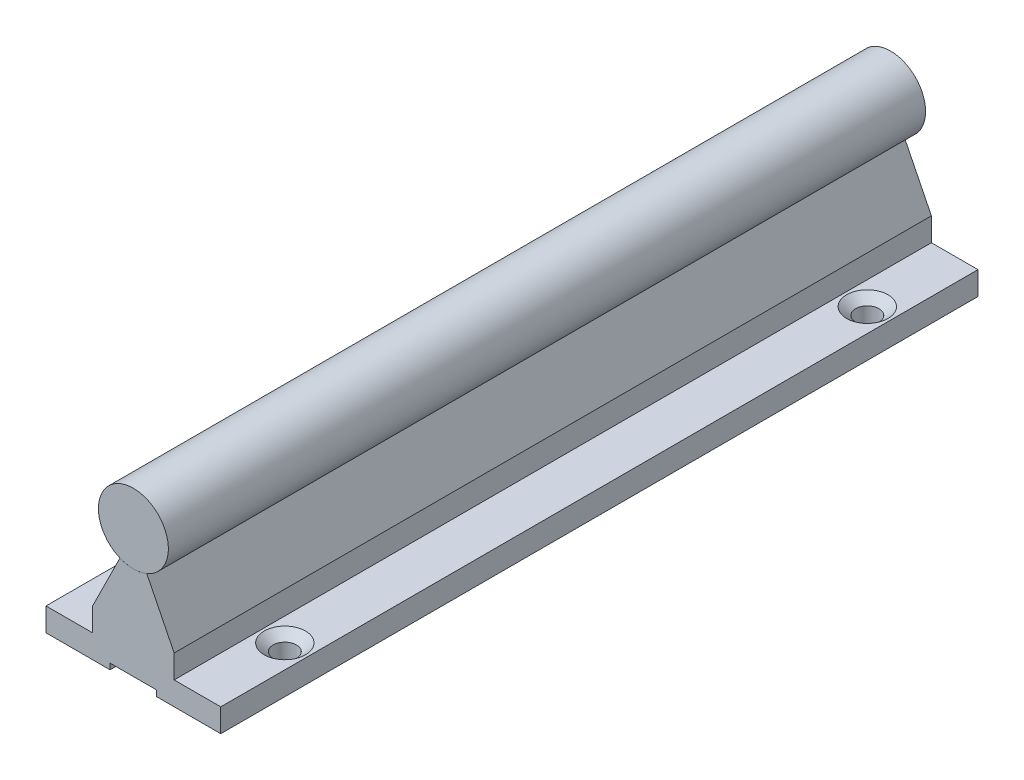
ISO-10303-21;
HEADER;
FILE_DESCRIPTION(('STEP AP214'),'2;1');
FILE_NAME('part.step','',(''),(''),'','','');
FILE_SCHEMA(('AUTOMOTIVE_DESIGN { 1 0 10303 214 1 1 1 1 }'));
ENDSEC;
DATA;
#1=APPLICATION_CONTEXT('core data for automotive mechanical design processes');
#2=APPLICATION_PROTOCOL_DEFINITION('international standard','automotive_design',2000,#1);
#3=PRODUCT_CONTEXT('',#1,'mechanical');
#4=PRODUCT('Part','Part','',(#3));
#5=PRODUCT_RELATED_PRODUCT_CATEGORY('part','',(#4));
#6=PRODUCT_DEFINITION_FORMATION('','',#4);
#7=PRODUCT_DEFINITION_CONTEXT('part definition',#1,'design');
#8=PRODUCT_DEFINITION('design','',#6,#7);
#9=PRODUCT_DEFINITION_SHAPE('','',#8);
#10=(LENGTH_UNIT() NAMED_UNIT(*) SI_UNIT(.MILLI.,.METRE.));
#11=(NAMED_UNIT(*) PLANE_ANGLE_UNIT() SI_UNIT($,.RADIAN.));
#12=(NAMED_UNIT(*) SI_UNIT($,.STERADIAN.) SOLID_ANGLE_UNIT());
#13=UNCERTAINTY_MEASURE_WITH_UNIT(LENGTH_MEASURE(1.E-05),#10,'distance_accuracy_value','');
#14=(GEOMETRIC_REPRESENTATION_CONTEXT(3) GLOBAL_UNCERTAINTY_ASSIGNED_CONTEXT((#13)) GLOBAL_UNIT_ASSIGNED_CONTEXT((#10,
#11,#12)) REPRESENTATION_CONTEXT('',''));
#15=CARTESIAN_POINT('',(0.,0.,0.));
#16=DIRECTION('',(0.,0.,1.));
#17=DIRECTION('',(1.,0.,0.));
#18=AXIS2_PLACEMENT_3D('',#15,#16,#17);
#19=CARTESIAN_POINT('',(0.,8.5,750.));
#20=DIRECTION('',(0.,0.,-1.));
#21=DIRECTION('',(-1.,0.,0.));
#22=AXIS2_PLACEMENT_3D('',#19,#20,#21);
#23=CYLINDRICAL_SURFACE('',#22,6.);
#24=CARTESIAN_POINT('',(0.,8.5,324.866250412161));
#25=DIRECTION('',(0.,0.,1.));
#26=DIRECTION('',(1.,0.,0.));
#27=AXIS2_PLACEMENT_3D('',#24,#25,#26);
#28=CIRCLE('',#27,6.);
#29=CARTESIAN_POINT('',(6.,8.5,324.866250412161));
#30=VERTEX_POINT('',#29);
#31=EDGE_CURVE('E11',#30,#30,#28,.T.);
#32=ORIENTED_EDGE('',*,*,#31,.T.);
#33=EDGE_LOOP('',(#32));
#34=FACE_BOUND('',#33,.T.);
#35=CARTESIAN_POINT('',(0.,8.5,454.866250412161));
#36=DIRECTION('',(0.,0.,-1.));
#37=DIRECTION('',(-1.,0.,0.));
#38=AXIS2_PLACEMENT_3D('',#35,#36,#37);
#39=CIRCLE('',#38,6.);
#40=CARTESIAN_POINT('',(-6.,8.5,454.866250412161));
#41=VERTEX_POINT('',#40);
#42=EDGE_CURVE('E60',#41,#41,#39,.T.);
#43=ORIENTED_EDGE('',*,*,#42,.T.);
#44=EDGE_LOOP('',(#43));
#45=FACE_BOUND('',#44,.T.);
#46=ADVANCED_FACE('F54',(#34,#45),#23,.T.);
#47=CARTESIAN_POINT('',(-15.,71.5,454.866250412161));
#48=DIRECTION('',(0.,0.,-1.));
#49=DIRECTION('',(-1.,0.,0.));
#50=AXIS2_PLACEMENT_3D('',#47,#48,#49);
#51=PLANE('',#50);
#52=ORIENTED_EDGE('',*,*,#42,.F.);
#53=EDGE_LOOP('',(#52));
#54=FACE_BOUND('',#53,.T.);
#55=ADVANCED_FACE('F67',(#54),#51,.F.);
#56=CARTESIAN_POINT('',(-15.,71.5,324.866250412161));
#57=DIRECTION('',(0.,0.,1.));
#58=DIRECTION('',(1.,0.,0.));
#59=AXIS2_PLACEMENT_3D('',#56,#57,#58);
#60=PLANE('',#59);
#61=ORIENTED_EDGE('',*,*,#31,.F.);
#62=EDGE_LOOP('',(#61));
#63=FACE_BOUND('',#62,.T.);
#64=ADVANCED_FACE('F69',(#63),#60,.F.);
#65=CLOSED_SHELL('',(#46,#55,#64));
#66=MANIFOLD_SOLID_BREP('B2',#65);
#67=CARTESIAN_POINT('',(-15.,-10.5,750.));
#68=DIRECTION('',(0.,-1.,0.));
#69=DIRECTION('',(0.,0.,-1.));
#70=AXIS2_PLACEMENT_3D('',#67,#68,#69);
#71=PLANE('',#70);
#72=CARTESIAN_POINT('',(-11.000000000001,-10.5,439.866250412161));
#73=DIRECTION('',(0.,1.,0.));
#74=DIRECTION('',(0.,0.,1.));
#75=AXIS2_PLACEMENT_3D('',#72,#73,#74);
#76=CIRCLE('',#75,3.5433);
#77=CARTESIAN_POINT('',(-11.000000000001,-10.5,443.409550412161));
#78=VERTEX_POINT('',#77);
#79=EDGE_CURVE('E263',#78,#78,#76,.T.);
#80=ORIENTED_EDGE('',*,*,#79,.F.);
#81=EDGE_LOOP('',(#80));
#82=FACE_BOUND('',#81,.T.);
#83=CARTESIAN_POINT('',(-11.0000000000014,-10.5,339.866250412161));
#84=DIRECTION('',(0.,1.,0.));
#85=DIRECTION('',(0.,0.,1.));
#86=AXIS2_PLACEMENT_3D('',#83,#84,#85);
#87=CIRCLE('',#86,3.5433);
#88=CARTESIAN_POINT('',(-11.0000000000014,-10.5,343.409550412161));
#89=VERTEX_POINT('',#88);
#90=EDGE_CURVE('E280',#89,#89,#87,.T.);
#91=ORIENTED_EDGE('',*,*,#90,.F.);
#92=EDGE_LOOP('',(#91));
#93=FACE_BOUND('',#92,.T.);
#94=DIRECTION('',(0.,0.,-1.));
#95=VECTOR('',#94,1.);
#96=CARTESIAN_POINT('',(-7.,-10.5,750.));
#97=LINE('',#96,#95);
#98=CARTESIAN_POINT('',(-7.,-10.5,454.866250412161));
#99=VERTEX_POINT('',#98);
#100=CARTESIAN_POINT('',(-7.,-10.5,324.866250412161));
#101=VERTEX_POINT('',#100);
#102=EDGE_CURVE('E225',#99,#101,#97,.T.);
#103=ORIENTED_EDGE('',*,*,#102,.T.);
#104=DIRECTION('',(-1.,0.,0.));
#105=VECTOR('',#104,1.);
#106=CARTESIAN_POINT('',(-15.,-10.5,324.866250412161));
#107=LINE('',#106,#105);
#108=CARTESIAN_POINT('',(-15.,-10.5,324.866250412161));
#109=VERTEX_POINT('',#108);
#110=EDGE_CURVE('E261',#101,#109,#107,.T.);
#111=ORIENTED_EDGE('',*,*,#110,.T.);
#112=DIRECTION('',(0.,0.,-1.));
#113=VECTOR('',#112,1.);
#114=CARTESIAN_POINT('',(-15.,-10.5,750.));
#115=LINE('',#114,#113);
#116=CARTESIAN_POINT('',(-15.,-10.5,454.866250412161));
#117=VERTEX_POINT('',#116);
#118=EDGE_CURVE('E219',#117,#109,#115,.T.);
#119=ORIENTED_EDGE('',*,*,#118,.F.);
#120=DIRECTION('',(1.,0.,0.));
#121=VECTOR('',#120,1.);
#122=CARTESIAN_POINT('',(-15.,-10.5,454.866250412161));
#123=LINE('',#122,#121);
#124=EDGE_CURVE('E356',#117,#99,#123,.T.);
#125=ORIENTED_EDGE('',*,*,#124,.T.);
#126=EDGE_LOOP('',(#103,#111,#119,#125));
#127=FACE_BOUND('',#126,.T.);
#128=ADVANCED_FACE('F98',(#82,#93,#127),#71,.F.);
#129=CARTESIAN_POINT('',(15.,-10.5,750.));
#130=DIRECTION('',(-1.,0.,0.));
#131=DIRECTION('',(0.,0.,1.));
#132=AXIS2_PLACEMENT_3D('',#129,#130,#131);
#133=PLANE('',#132);
#134=DIRECTION('',(0.,0.,-1.));
#135=VECTOR('',#134,1.);
#136=CARTESIAN_POINT('',(15.,-14.5,750.));
#137=LINE('',#136,#135);
#138=CARTESIAN_POINT('',(15.,-14.5,454.866250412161));
#139=VERTEX_POINT('',#138);
#140=CARTESIAN_POINT('',(15.,-14.5,324.866250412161));
#141=VERTEX_POINT('',#140);
#142=EDGE_CURVE('E293',#139,#141,#137,.T.);
#143=ORIENTED_EDGE('',*,*,#142,.T.);
#144=DIRECTION('',(0.,-1.,0.));
#145=VECTOR('',#144,1.);
#146=CARTESIAN_POINT('',(15.,71.5,324.866250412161));
#147=LINE('',#146,#145);
#148=CARTESIAN_POINT('',(15.,-10.5,324.866250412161));
#149=VERTEX_POINT('',#148);
#150=EDGE_CURVE('E122',#149,#141,#147,.T.);
#151=ORIENTED_EDGE('',*,*,#150,.F.);
#152=DIRECTION('',(0.,0.,-1.));
#153=VECTOR('',#152,1.);
#154=CARTESIAN_POINT('',(15.,-10.5,750.));
#155=LINE('',#154,#153);
#156=CARTESIAN_POINT('',(15.,-10.5,454.866250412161));
#157=VERTEX_POINT('',#156);
#158=EDGE_CURVE('E52',#157,#149,#155,.T.);
#159=ORIENTED_EDGE('',*,*,#158,.F.);
#160=DIRECTION('',(0.,-1.,0.));
#161=VECTOR('',#160,1.);
#162=CARTESIAN_POINT('',(15.,71.5,454.866250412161));
#163=LINE('',#162,#161);
#164=EDGE_CURVE('E369',#157,#139,#163,.T.);
#165=ORIENTED_EDGE('',*,*,#164,.T.);
#166=EDGE_LOOP('',(#143,#151,#159,#165));
#167=FACE_BOUND('',#166,.T.);
#168=ADVANCED_FACE('F100',(#167),#133,.F.);
#169=CARTESIAN_POINT('',(7.,-10.5,750.));
#170=DIRECTION('',(0.,-1.,0.));
#171=DIRECTION('',(0.,0.,-1.));
#172=AXIS2_PLACEMENT_3D('',#169,#170,#171);
#173=PLANE('',#172);
#174=CARTESIAN_POINT('',(10.999999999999,-10.5,439.866250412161));
#175=DIRECTION('',(0.,1.,0.));
#176=DIRECTION('',(0.,0.,1.));
#177=AXIS2_PLACEMENT_3D('',#174,#175,#176);
#178=CIRCLE('',#177,3.5433);
#179=CARTESIAN_POINT('',(10.999999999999,-10.5,443.409550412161));
#180=VERTEX_POINT('',#179);
#181=EDGE_CURVE('E274',#180,#180,#178,.T.);
#182=ORIENTED_EDGE('',*,*,#181,.F.);
#183=EDGE_LOOP('',(#182));
#184=FACE_BOUND('',#183,.T.);
#185=CARTESIAN_POINT('',(10.9999999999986,-10.5,339.866250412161));
#186=DIRECTION('',(0.,1.,0.));
#187=DIRECTION('',(0.,0.,1.));
#188=AXIS2_PLACEMENT_3D('',#185,#186,#187);
#189=CIRCLE('',#188,3.5433);
#190=CARTESIAN_POINT('',(10.9999999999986,-10.5,343.409550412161));
#191=VERTEX_POINT('',#190);
#192=EDGE_CURVE('E283',#191,#191,#189,.T.);
#193=ORIENTED_EDGE('',*,*,#192,.F.);
#194=EDGE_LOOP('',(#193));
#195=FACE_BOUND('',#194,.T.);
#196=ORIENTED_EDGE('',*,*,#158,.T.);
#197=DIRECTION('',(-1.,0.,0.));
#198=VECTOR('',#197,1.);
#199=CARTESIAN_POINT('',(7.,-10.5,324.866250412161));
#200=LINE('',#199,#198);
#201=CARTESIAN_POINT('',(7.,-10.5,324.866250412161));
#202=VERTEX_POINT('',#201);
#203=EDGE_CURVE('E260',#149,#202,#200,.T.);
#204=ORIENTED_EDGE('',*,*,#203,.T.);
#205=DIRECTION('',(0.,0.,-1.));
#206=VECTOR('',#205,1.);
#207=CARTESIAN_POINT('',(7.,-10.5,750.));
#208=LINE('',#207,#206);
#209=CARTESIAN_POINT('',(7.,-10.5,454.866250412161));
#210=VERTEX_POINT('',#209);
#211=EDGE_CURVE('E107',#210,#202,#208,.T.);
#212=ORIENTED_EDGE('',*,*,#211,.F.);
#213=DIRECTION('',(1.,0.,0.));
#214=VECTOR('',#213,1.);
#215=CARTESIAN_POINT('',(7.,-10.5,454.866250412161));
#216=LINE('',#215,#214);
#217=EDGE_CURVE('E258',#210,#157,#216,.T.);
#218=ORIENTED_EDGE('',*,*,#217,.T.);
#219=EDGE_LOOP('',(#196,#204,#212,#218));
#220=FACE_BOUND('',#219,.T.);
#221=ADVANCED_FACE('F257',(#184,#195,#220),#173,.F.);
#222=CARTESIAN_POINT('',(7.,-10.5,750.));
#223=DIRECTION('',(-1.,0.,0.));
#224=DIRECTION('',(0.,-1.,0.));
#225=AXIS2_PLACEMENT_3D('',#222,#223,#224);
#226=PLANE('',#225);
#227=ORIENTED_EDGE('',*,*,#211,.T.);
#228=DIRECTION('',(0.,1.,0.));
#229=VECTOR('',#228,1.);
#230=CARTESIAN_POINT('',(7.,-10.5,324.866250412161));
#231=LINE('',#230,#229);
#232=CARTESIAN_POINT('',(7.,-6.5,324.866250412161));
#233=VERTEX_POINT('',#232);
#234=EDGE_CURVE('E252',#202,#233,#231,.T.);
#235=ORIENTED_EDGE('',*,*,#234,.T.);
#236=DIRECTION('',(0.,0.,-1.));
#237=VECTOR('',#236,1.);
#238=CARTESIAN_POINT('',(7.,-6.5,750.));
#239=LINE('',#238,#237);
#240=CARTESIAN_POINT('',(7.,-6.5,454.866250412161));
#241=VERTEX_POINT('',#240);
#242=EDGE_CURVE('E242',#241,#233,#239,.T.);
#243=ORIENTED_EDGE('',*,*,#242,.F.);
#244=DIRECTION('',(0.,-1.,0.));
#245=VECTOR('',#244,1.);
#246=CARTESIAN_POINT('',(7.,-10.5,454.866250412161));
#247=LINE('',#246,#245);
#248=EDGE_CURVE('E253',#241,#210,#247,.T.);
#249=ORIENTED_EDGE('',*,*,#248,.T.);
#250=EDGE_LOOP('',(#227,#235,#243,#249));
#251=FACE_BOUND('',#250,.T.);
#252=ADVANCED_FACE('F250',(#251),#226,.F.);
#253=CARTESIAN_POINT('',(7.,-6.5,750.));
#254=DIRECTION('',(-0.895711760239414,-0.444635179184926,0.));
#255=DIRECTION('',(0.444635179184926,-0.895711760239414,0.));
#256=AXIS2_PLACEMENT_3D('',#253,#254,#255);
#257=PLANE('',#256);
#258=ORIENTED_EDGE('',*,*,#242,.T.);
#259=DIRECTION('',(-0.444635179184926,0.895711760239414,0.));
#260=VECTOR('',#259,1.);
#261=CARTESIAN_POINT('',(7.,-6.5,324.866250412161));
#262=LINE('',#261,#260);
#263=CARTESIAN_POINT('',(2.30401201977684,2.9600064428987,324.866250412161));
#264=VERTEX_POINT('',#263);
#265=EDGE_CURVE('E265',#233,#264,#262,.T.);
#266=ORIENTED_EDGE('',*,*,#265,.T.);
#267=DIRECTION('',(0.,0.,-1.));
#268=VECTOR('',#267,1.);
#269=CARTESIAN_POINT('',(2.30401201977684,2.9600064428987,750.));
#270=LINE('',#269,#268);
#271=CARTESIAN_POINT('',(2.30401201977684,2.9600064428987,454.866250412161));
#272=VERTEX_POINT('',#271);
#273=EDGE_CURVE('E239',#272,#264,#270,.T.);
#274=ORIENTED_EDGE('',*,*,#273,.F.);
#275=DIRECTION('',(0.444635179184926,-0.895711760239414,0.));
#276=VECTOR('',#275,1.);
#277=CARTESIAN_POINT('',(7.,-6.5,454.866250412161));
#278=LINE('',#277,#276);
#279=EDGE_CURVE('E346',#272,#241,#278,.T.);
#280=ORIENTED_EDGE('',*,*,#279,.T.);
#281=EDGE_LOOP('',(#258,#266,#274,#280));
#282=FACE_BOUND('',#281,.T.);
#283=ADVANCED_FACE('F338',(#282),#257,.F.);
#284=CARTESIAN_POINT('',(0.,8.5,750.));
#285=DIRECTION('',(0.,0.,-1.));
#286=DIRECTION('',(-1.,0.,0.));
#287=AXIS2_PLACEMENT_3D('',#284,#285,#286);
#288=CYLINDRICAL_SURFACE('',#287,6.);
#289=ORIENTED_EDGE('',*,*,#273,.T.);
#290=CARTESIAN_POINT('',(0.,8.5,324.866250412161));
#291=DIRECTION('',(0.,0.,1.));
#292=DIRECTION('',(1.,0.,0.));
#293=AXIS2_PLACEMENT_3D('',#290,#291,#292);
#294=CIRCLE('',#293,6.);
#295=CARTESIAN_POINT('',(-2.30401201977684,2.96000644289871,324.866250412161));
#296=VERTEX_POINT('',#295);
#297=EDGE_CURVE('E333',#264,#296,#294,.F.);
#298=ORIENTED_EDGE('',*,*,#297,.T.);
#299=DIRECTION('',(0.,0.,-1.));
#300=VECTOR('',#299,1.);
#301=CARTESIAN_POINT('',(-2.30401201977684,2.96000644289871,750.));
#302=LINE('',#301,#300);
#303=CARTESIAN_POINT('',(-2.30401201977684,2.96000644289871,454.866250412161));
#304=VERTEX_POINT('',#303);
#305=EDGE_CURVE('E236',#304,#296,#302,.T.);
#306=ORIENTED_EDGE('',*,*,#305,.F.);
#307=CARTESIAN_POINT('',(0.,8.5,454.866250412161));
#308=DIRECTION('',(0.,0.,-1.));
#309=DIRECTION('',(-1.,0.,0.));
#310=AXIS2_PLACEMENT_3D('',#307,#308,#309);
#311=CIRCLE('',#310,6.);
#312=EDGE_CURVE('E344',#304,#272,#311,.F.);
#313=ORIENTED_EDGE('',*,*,#312,.T.);
#314=EDGE_LOOP('',(#289,#298,#306,#313));
#315=FACE_BOUND('',#314,.T.);
#316=ADVANCED_FACE('F342',(#315),#288,.F.);
#317=CARTESIAN_POINT('',(-7.,-6.5,750.));
#318=DIRECTION('',(0.895711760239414,-0.444635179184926,0.));
#319=DIRECTION('',(0.444635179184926,0.895711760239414,0.));
#320=AXIS2_PLACEMENT_3D('',#317,#318,#319);
#321=PLANE('',#320);
#322=ORIENTED_EDGE('',*,*,#305,.T.);
#323=DIRECTION('',(-0.444635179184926,-0.895711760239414,0.));
#324=VECTOR('',#323,1.);
#325=CARTESIAN_POINT('',(-7.,-6.5,324.866250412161));
#326=LINE('',#325,#324);
#327=CARTESIAN_POINT('',(-7.,-6.5,324.866250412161));
#328=VERTEX_POINT('',#327);
#329=EDGE_CURVE('E325',#296,#328,#326,.T.);
#330=ORIENTED_EDGE('',*,*,#329,.T.);
#331=DIRECTION('',(0.,0.,-1.));
#332=VECTOR('',#331,1.);
#333=CARTESIAN_POINT('',(-7.,-6.5,750.));
#334=LINE('',#333,#332);
#335=CARTESIAN_POINT('',(-7.,-6.5,454.866250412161));
#336=VERTEX_POINT('',#335);
#337=EDGE_CURVE('E233',#336,#328,#334,.T.);
#338=ORIENTED_EDGE('',*,*,#337,.F.);
#339=DIRECTION('',(0.444635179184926,0.895711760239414,0.));
#340=VECTOR('',#339,1.);
#341=CARTESIAN_POINT('',(-7.,-6.5,454.866250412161));
#342=LINE('',#341,#340);
#343=EDGE_CURVE('E347',#336,#304,#342,.T.);
#344=ORIENTED_EDGE('',*,*,#343,.T.);
#345=EDGE_LOOP('',(#322,#330,#338,#344));
#346=FACE_BOUND('',#345,.T.);
#347=ADVANCED_FACE('F381',(#346),#321,.F.);
#348=CARTESIAN_POINT('',(-7.,-10.5,750.));
#349=DIRECTION('',(1.,0.,0.));
#350=DIRECTION('',(0.,1.,0.));
#351=AXIS2_PLACEMENT_3D('',#348,#349,#350);
#352=PLANE('',#351);
#353=ORIENTED_EDGE('',*,*,#337,.T.);
#354=DIRECTION('',(0.,-1.,0.));
#355=VECTOR('',#354,1.);
#356=CARTESIAN_POINT('',(-7.,-10.5,324.866250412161));
#357=LINE('',#356,#355);
#358=EDGE_CURVE('E322',#328,#101,#357,.T.);
#359=ORIENTED_EDGE('',*,*,#358,.T.);
#360=ORIENTED_EDGE('',*,*,#102,.F.);
#361=DIRECTION('',(0.,1.,0.));
#362=VECTOR('',#361,1.);
#363=CARTESIAN_POINT('',(-7.,-10.5,454.866250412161));
#364=LINE('',#363,#362);
#365=EDGE_CURVE('E350',#99,#336,#364,.T.);
#366=ORIENTED_EDGE('',*,*,#365,.T.);
#367=EDGE_LOOP('',(#353,#359,#360,#366));
#368=FACE_BOUND('',#367,.T.);
#369=ADVANCED_FACE('F379',(#368),#352,.F.);
#370=CARTESIAN_POINT('',(-15.,-10.5,750.));
#371=DIRECTION('',(1.,0.,0.));
#372=DIRECTION('',(0.,0.,-1.));
#373=AXIS2_PLACEMENT_3D('',#370,#371,#372);
#374=PLANE('',#373);
#375=ORIENTED_EDGE('',*,*,#118,.T.);
#376=DIRECTION('',(0.,-1.,0.));
#377=VECTOR('',#376,1.);
#378=CARTESIAN_POINT('',(-15.,71.5,324.866250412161));
#379=LINE('',#378,#377);
#380=CARTESIAN_POINT('',(-15.,-14.5,324.866250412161));
#381=VERTEX_POINT('',#380);
#382=EDGE_CURVE('E201',#109,#381,#379,.T.);
#383=ORIENTED_EDGE('',*,*,#382,.T.);
#384=DIRECTION('',(0.,0.,-1.));
#385=VECTOR('',#384,1.);
#386=CARTESIAN_POINT('',(-15.,-14.5,750.));
#387=LINE('',#386,#385);
#388=CARTESIAN_POINT('',(-15.,-14.5,454.866250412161));
#389=VERTEX_POINT('',#388);
#390=EDGE_CURVE('E217',#389,#381,#387,.T.);
#391=ORIENTED_EDGE('',*,*,#390,.F.);
#392=DIRECTION('',(0.,-1.,0.));
#393=VECTOR('',#392,1.);
#394=CARTESIAN_POINT('',(-15.,71.5,454.866250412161));
#395=LINE('',#394,#393);
#396=EDGE_CURVE('E367',#117,#389,#395,.T.);
#397=ORIENTED_EDGE('',*,*,#396,.F.);
#398=EDGE_LOOP('',(#375,#383,#391,#397));
#399=FACE_BOUND('',#398,.T.);
#400=ADVANCED_FACE('F215',(#399),#374,.F.);
#401=CARTESIAN_POINT('',(-7.,-14.5,750.));
#402=DIRECTION('',(0.,1.,0.));
#403=DIRECTION('',(0.,0.,1.));
#404=AXIS2_PLACEMENT_3D('',#401,#402,#403);
#405=PLANE('',#404);
#406=CARTESIAN_POINT('',(-11.0000000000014,-14.5,339.866250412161));
#407=DIRECTION('',(0.,1.,0.));
#408=DIRECTION('',(0.,0.,1.));
#409=AXIS2_PLACEMENT_3D('',#406,#407,#408);
#410=CIRCLE('',#409,2.);
#411=CARTESIAN_POINT('',(-11.0000000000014,-14.5,341.866250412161));
#412=VERTEX_POINT('',#411);
#413=EDGE_CURVE('E294',#412,#412,#410,.T.);
#414=ORIENTED_EDGE('',*,*,#413,.T.);
#415=EDGE_LOOP('',(#414));
#416=FACE_BOUND('',#415,.T.);
#417=CARTESIAN_POINT('',(-11.000000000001,-14.5,439.866250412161));
#418=DIRECTION('',(0.,1.,0.));
#419=DIRECTION('',(0.,0.,1.));
#420=AXIS2_PLACEMENT_3D('',#417,#418,#419);
#421=CIRCLE('',#420,2.);
#422=CARTESIAN_POINT('',(-11.000000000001,-14.5,441.866250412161));
#423=VERTEX_POINT('',#422);
#424=EDGE_CURVE('E290',#423,#423,#421,.T.);
#425=ORIENTED_EDGE('',*,*,#424,.T.);
#426=EDGE_LOOP('',(#425));
#427=FACE_BOUND('',#426,.T.);
#428=ORIENTED_EDGE('',*,*,#390,.T.);
#429=DIRECTION('',(-1.,0.,0.));
#430=VECTOR('',#429,1.);
#431=CARTESIAN_POINT('',(-15.,-14.5,324.866250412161));
#432=LINE('',#431,#430);
#433=CARTESIAN_POINT('',(-4.,-14.5,324.866250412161));
#434=VERTEX_POINT('',#433);
#435=EDGE_CURVE('E198',#434,#381,#432,.T.);
#436=ORIENTED_EDGE('',*,*,#435,.F.);
#437=DIRECTION('',(0.,0.,-1.));
#438=VECTOR('',#437,1.);
#439=CARTESIAN_POINT('',(-4.,-14.5,750.));
#440=LINE('',#439,#438);
#441=CARTESIAN_POINT('',(-4.,-14.5,454.866250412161));
#442=VERTEX_POINT('',#441);
#443=EDGE_CURVE('E223',#442,#434,#440,.T.);
#444=ORIENTED_EDGE('',*,*,#443,.F.);
#445=DIRECTION('',(1.,0.,0.));
#446=VECTOR('',#445,1.);
#447=CARTESIAN_POINT('',(-15.,-14.5,454.866250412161));
#448=LINE('',#447,#446);
#449=EDGE_CURVE('E210',#389,#442,#448,.T.);
#450=ORIENTED_EDGE('',*,*,#449,.F.);
#451=EDGE_LOOP('',(#428,#436,#444,#450));
#452=FACE_BOUND('',#451,.T.);
#453=ADVANCED_FACE('F222',(#416,#427,#452),#405,.F.);
#454=CARTESIAN_POINT('',(-4.,-14.5,750.));
#455=DIRECTION('',(-1.,0.,0.));
#456=DIRECTION('',(0.,0.,1.));
#457=AXIS2_PLACEMENT_3D('',#454,#455,#456);
#458=PLANE('',#457);
#459=ORIENTED_EDGE('',*,*,#443,.T.);
#460=DIRECTION('',(0.,1.,0.));
#461=VECTOR('',#460,1.);
#462=CARTESIAN_POINT('',(-4.,-14.5,324.866250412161));
#463=LINE('',#462,#461);
#464=CARTESIAN_POINT('',(-4.,-13.5,324.866250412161));
#465=VERTEX_POINT('',#464);
#466=EDGE_CURVE('E204',#434,#465,#463,.T.);
#467=ORIENTED_EDGE('',*,*,#466,.T.);
#468=DIRECTION('',(0.,0.,-1.));
#469=VECTOR('',#468,1.);
#470=CARTESIAN_POINT('',(-4.,-13.5,750.));
#471=LINE('',#470,#469);
#472=CARTESIAN_POINT('',(-4.,-13.5,454.866250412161));
#473=VERTEX_POINT('',#472);
#474=EDGE_CURVE('E227',#473,#465,#471,.T.);
#475=ORIENTED_EDGE('',*,*,#474,.F.);
#476=DIRECTION('',(0.,-1.,0.));
#477=VECTOR('',#476,1.);
#478=CARTESIAN_POINT('',(-4.,-14.5,454.866250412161));
#479=LINE('',#478,#477);
#480=EDGE_CURVE('E321',#473,#442,#479,.T.);
#481=ORIENTED_EDGE('',*,*,#480,.T.);
#482=EDGE_LOOP('',(#459,#467,#475,#481));
#483=FACE_BOUND('',#482,.T.);
#484=ADVANCED_FACE('F320',(#483),#458,.F.);
#485=CARTESIAN_POINT('',(-4.,-13.5,750.));
#486=DIRECTION('',(0.,1.,0.));
#487=DIRECTION('',(0.,0.,1.));
#488=AXIS2_PLACEMENT_3D('',#485,#486,#487);
#489=PLANE('',#488);
#490=ORIENTED_EDGE('',*,*,#474,.T.);
#491=DIRECTION('',(1.,0.,0.));
#492=VECTOR('',#491,1.);
#493=CARTESIAN_POINT('',(-4.,-13.5,324.866250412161));
#494=LINE('',#493,#492);
#495=CARTESIAN_POINT('',(4.,-13.5,324.866250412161));
#496=VERTEX_POINT('',#495);
#497=EDGE_CURVE('E316',#465,#496,#494,.T.);
#498=ORIENTED_EDGE('',*,*,#497,.T.);
#499=DIRECTION('',(0.,0.,-1.));
#500=VECTOR('',#499,1.);
#501=CARTESIAN_POINT('',(4.,-13.5,750.));
#502=LINE('',#501,#500);
#503=CARTESIAN_POINT('',(4.,-13.5,454.866250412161));
#504=VERTEX_POINT('',#503);
#505=EDGE_CURVE('E307',#504,#496,#502,.T.);
#506=ORIENTED_EDGE('',*,*,#505,.F.);
#507=DIRECTION('',(-1.,0.,0.));
#508=VECTOR('',#507,1.);
#509=CARTESIAN_POINT('',(-4.,-13.5,454.866250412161));
#510=LINE('',#509,#508);
#511=EDGE_CURVE('E317',#504,#473,#510,.T.);
#512=ORIENTED_EDGE('',*,*,#511,.T.);
#513=EDGE_LOOP('',(#490,#498,#506,#512));
#514=FACE_BOUND('',#513,.T.);
#515=ADVANCED_FACE('F314',(#514),#489,.F.);
#516=CARTESIAN_POINT('',(4.,-14.5,750.));
#517=DIRECTION('',(1.,0.,0.));
#518=DIRECTION('',(0.,1.,0.));
#519=AXIS2_PLACEMENT_3D('',#516,#517,#518);
#520=PLANE('',#519);
#521=ORIENTED_EDGE('',*,*,#505,.T.);
#522=DIRECTION('',(0.,-1.,0.));
#523=VECTOR('',#522,1.);
#524=CARTESIAN_POINT('',(4.,-14.5,324.866250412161));
#525=LINE('',#524,#523);
#526=CARTESIAN_POINT('',(4.,-14.5,324.866250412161));
#527=VERTEX_POINT('',#526);
#528=EDGE_CURVE('E327',#496,#527,#525,.T.);
#529=ORIENTED_EDGE('',*,*,#528,.T.);
#530=DIRECTION('',(0.,0.,-1.));
#531=VECTOR('',#530,1.);
#532=CARTESIAN_POINT('',(4.,-14.5,750.));
#533=LINE('',#532,#531);
#534=CARTESIAN_POINT('',(4.,-14.5,454.866250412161));
#535=VERTEX_POINT('',#534);
#536=EDGE_CURVE('E304',#535,#527,#533,.T.);
#537=ORIENTED_EDGE('',*,*,#536,.F.);
#538=DIRECTION('',(0.,1.,0.));
#539=VECTOR('',#538,1.);
#540=CARTESIAN_POINT('',(4.,-14.5,454.866250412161));
#541=LINE('',#540,#539);
#542=EDGE_CURVE('E114',#535,#504,#541,.T.);
#543=ORIENTED_EDGE('',*,*,#542,.T.);
#544=EDGE_LOOP('',(#521,#529,#537,#543));
#545=FACE_BOUND('',#544,.T.);
#546=ADVANCED_FACE('F361',(#545),#520,.F.);
#547=CARTESIAN_POINT('',(7.,-14.5,750.));
#548=DIRECTION('',(0.,1.,0.));
#549=DIRECTION('',(0.,0.,1.));
#550=AXIS2_PLACEMENT_3D('',#547,#548,#549);
#551=PLANE('',#550);
#552=CARTESIAN_POINT('',(10.9999999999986,-14.5,339.866250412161));
#553=DIRECTION('',(0.,1.,0.));
#554=DIRECTION('',(0.,0.,1.));
#555=AXIS2_PLACEMENT_3D('',#552,#553,#554);
#556=CIRCLE('',#555,2.);
#557=CARTESIAN_POINT('',(10.9999999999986,-14.5,341.866250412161));
#558=VERTEX_POINT('',#557);
#559=EDGE_CURVE('E289',#558,#558,#556,.T.);
#560=ORIENTED_EDGE('',*,*,#559,.T.);
#561=EDGE_LOOP('',(#560));
#562=FACE_BOUND('',#561,.T.);
#563=CARTESIAN_POINT('',(10.999999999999,-14.5,439.866250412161));
#564=DIRECTION('',(0.,1.,0.));
#565=DIRECTION('',(0.,0.,1.));
#566=AXIS2_PLACEMENT_3D('',#563,#564,#565);
#567=CIRCLE('',#566,2.);
#568=CARTESIAN_POINT('',(10.999999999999,-14.5,441.866250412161));
#569=VERTEX_POINT('',#568);
#570=EDGE_CURVE('E297',#569,#569,#567,.T.);
#571=ORIENTED_EDGE('',*,*,#570,.T.);
#572=EDGE_LOOP('',(#571));
#573=FACE_BOUND('',#572,.T.);
#574=ORIENTED_EDGE('',*,*,#536,.T.);
#575=EDGE_CURVE('E209',#141,#527,#432,.T.);
#576=ORIENTED_EDGE('',*,*,#575,.F.);
#577=ORIENTED_EDGE('',*,*,#142,.F.);
#578=EDGE_CURVE('E365',#535,#139,#448,.T.);
#579=ORIENTED_EDGE('',*,*,#578,.F.);
#580=EDGE_LOOP('',(#574,#576,#577,#579));
#581=FACE_BOUND('',#580,.T.);
#582=ADVANCED_FACE('F363',(#562,#573,#581),#551,.F.);
#583=CARTESIAN_POINT('',(10.999999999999,-14.5,439.866250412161));
#584=DIRECTION('',(0.,1.,0.));
#585=DIRECTION('',(0.,0.,1.));
#586=AXIS2_PLACEMENT_3D('',#583,#584,#585);
#587=CYLINDRICAL_SURFACE('',#586,2.);
#588=CARTESIAN_POINT('',(10.999999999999,-11.7949824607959,439.866250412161));
#589=DIRECTION('',(0.,1.,0.));
#590=DIRECTION('',(0.,0.,1.));
#591=AXIS2_PLACEMENT_3D('',#588,#589,#590);
#592=CIRCLE('',#591,2.);
#593=CARTESIAN_POINT('',(10.999999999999,-11.7949824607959,441.866250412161));
#594=VERTEX_POINT('',#593);
#595=EDGE_CURVE('E277',#594,#594,#592,.T.);
#596=ORIENTED_EDGE('',*,*,#595,.T.);
#597=EDGE_LOOP('',(#596));
#598=FACE_BOUND('',#597,.T.);
#599=ORIENTED_EDGE('',*,*,#570,.F.);
#600=EDGE_LOOP('',(#599));
#601=FACE_BOUND('',#600,.T.);
#602=ADVANCED_FACE('F437',(#598,#601),#587,.F.);
#603=CARTESIAN_POINT('',(10.9999999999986,-14.5,339.866250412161));
#604=DIRECTION('',(0.,1.,0.));
#605=DIRECTION('',(0.,0.,1.));
#606=AXIS2_PLACEMENT_3D('',#603,#604,#605);
#607=CYLINDRICAL_SURFACE('',#606,2.);
#608=CARTESIAN_POINT('',(10.9999999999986,-11.7949824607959,339.866250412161));
#609=DIRECTION('',(0.,1.,0.));
#610=DIRECTION('',(0.,0.,1.));
#611=AXIS2_PLACEMENT_3D('',#608,#609,#610);
#612=CIRCLE('',#611,2.);
#613=CARTESIAN_POINT('',(10.9999999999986,-11.7949824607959,341.866250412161));
#614=VERTEX_POINT('',#613);
#615=EDGE_CURVE('E286',#614,#614,#612,.T.);
#616=ORIENTED_EDGE('',*,*,#615,.T.);
#617=EDGE_LOOP('',(#616));
#618=FACE_BOUND('',#617,.T.);
#619=ORIENTED_EDGE('',*,*,#559,.F.);
#620=EDGE_LOOP('',(#619));
#621=FACE_BOUND('',#620,.T.);
#622=ADVANCED_FACE('F433',(#618,#621),#607,.F.);
#623=CARTESIAN_POINT('',(-11.000000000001,-14.5,439.866250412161));
#624=DIRECTION('',(0.,1.,0.));
#625=DIRECTION('',(0.,0.,1.));
#626=AXIS2_PLACEMENT_3D('',#623,#624,#625);
#627=CYLINDRICAL_SURFACE('',#626,2.);
#628=CARTESIAN_POINT('',(-11.000000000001,-11.7949824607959,439.866250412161));
#629=DIRECTION('',(0.,1.,0.));
#630=DIRECTION('',(0.,0.,1.));
#631=AXIS2_PLACEMENT_3D('',#628,#629,#630);
#632=CIRCLE('',#631,2.);
#633=CARTESIAN_POINT('',(-11.000000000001,-11.7949824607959,441.866250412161));
#634=VERTEX_POINT('',#633);
#635=EDGE_CURVE('E271',#634,#634,#632,.T.);
#636=ORIENTED_EDGE('',*,*,#635,.T.);
#637=EDGE_LOOP('',(#636));
#638=FACE_BOUND('',#637,.T.);
#639=ORIENTED_EDGE('',*,*,#424,.F.);
#640=EDGE_LOOP('',(#639));
#641=FACE_BOUND('',#640,.T.);
#642=ADVANCED_FACE('F436',(#638,#641),#627,.F.);
#643=CARTESIAN_POINT('',(-11.0000000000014,-14.5,339.866250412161));
#644=DIRECTION('',(0.,1.,0.));
#645=DIRECTION('',(0.,0.,1.));
#646=AXIS2_PLACEMENT_3D('',#643,#644,#645);
#647=CYLINDRICAL_SURFACE('',#646,2.);
#648=CARTESIAN_POINT('',(-11.0000000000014,-11.7949824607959,339.866250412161));
#649=DIRECTION('',(0.,1.,0.));
#650=DIRECTION('',(0.,0.,1.));
#651=AXIS2_PLACEMENT_3D('',#648,#649,#650);
#652=CIRCLE('',#651,2.);
#653=CARTESIAN_POINT('',(-11.0000000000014,-11.7949824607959,341.866250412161));
#654=VERTEX_POINT('',#653);
#655=EDGE_CURVE('E102',#654,#654,#652,.T.);
#656=ORIENTED_EDGE('',*,*,#655,.T.);
#657=EDGE_LOOP('',(#656));
#658=FACE_BOUND('',#657,.T.);
#659=ORIENTED_EDGE('',*,*,#413,.F.);
#660=EDGE_LOOP('',(#659));
#661=FACE_BOUND('',#660,.T.);
#662=ADVANCED_FACE('F429',(#658,#661),#647,.F.);
#663=CARTESIAN_POINT('',(10.9999999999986,-10.5,339.866250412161));
#664=DIRECTION('',(0.,1.,0.));
#665=DIRECTION('',(0.,0.,1.));
#666=AXIS2_PLACEMENT_3D('',#663,#664,#665);
#667=CONICAL_SURFACE('',#666,3.5433,0.872664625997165);
#668=ORIENTED_EDGE('',*,*,#192,.T.);
#669=EDGE_LOOP('',(#668));
#670=FACE_BOUND('',#669,.T.);
#671=ORIENTED_EDGE('',*,*,#615,.F.);
#672=EDGE_LOOP('',(#671));
#673=FACE_BOUND('',#672,.T.);
#674=ADVANCED_FACE('F425',(#670,#673),#667,.F.);
#675=CARTESIAN_POINT('',(-11.0000000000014,-10.5,339.866250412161));
#676=DIRECTION('',(0.,1.,0.));
#677=DIRECTION('',(0.,0.,1.));
#678=AXIS2_PLACEMENT_3D('',#675,#676,#677);
#679=CONICAL_SURFACE('',#678,3.5433,0.872664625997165);
#680=ORIENTED_EDGE('',*,*,#90,.T.);
#681=EDGE_LOOP('',(#680));
#682=FACE_BOUND('',#681,.T.);
#683=ORIENTED_EDGE('',*,*,#655,.F.);
#684=EDGE_LOOP('',(#683));
#685=FACE_BOUND('',#684,.T.);
#686=ADVANCED_FACE('F428',(#682,#685),#679,.F.);
#687=CARTESIAN_POINT('',(10.999999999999,-10.5,439.866250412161));
#688=DIRECTION('',(0.,1.,0.));
#689=DIRECTION('',(0.,0.,1.));
#690=AXIS2_PLACEMENT_3D('',#687,#688,#689);
#691=CONICAL_SURFACE('',#690,3.5433,0.872664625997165);
#692=ORIENTED_EDGE('',*,*,#181,.T.);
#693=EDGE_LOOP('',(#692));
#694=FACE_BOUND('',#693,.T.);
#695=ORIENTED_EDGE('',*,*,#595,.F.);
#696=EDGE_LOOP('',(#695));
#697=FACE_BOUND('',#696,.T.);
#698=ADVANCED_FACE('F393',(#694,#697),#691,.F.);
#699=CARTESIAN_POINT('',(-11.000000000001,-10.5,439.866250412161));
#700=DIRECTION('',(0.,1.,0.));
#701=DIRECTION('',(0.,0.,1.));
#702=AXIS2_PLACEMENT_3D('',#699,#700,#701);
#703=CONICAL_SURFACE('',#702,3.5433,0.872664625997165);
#704=ORIENTED_EDGE('',*,*,#79,.T.);
#705=EDGE_LOOP('',(#704));
#706=FACE_BOUND('',#705,.T.);
#707=ORIENTED_EDGE('',*,*,#635,.F.);
#708=EDGE_LOOP('',(#707));
#709=FACE_BOUND('',#708,.T.);
#710=ADVANCED_FACE('F385',(#706,#709),#703,.F.);
#711=CARTESIAN_POINT('',(-15.,71.5,454.866250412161));
#712=DIRECTION('',(0.,0.,-1.));
#713=DIRECTION('',(-1.,0.,0.));
#714=AXIS2_PLACEMENT_3D('',#711,#712,#713);
#715=PLANE('',#714);
#716=ORIENTED_EDGE('',*,*,#396,.T.);
#717=ORIENTED_EDGE('',*,*,#449,.T.);
#718=ORIENTED_EDGE('',*,*,#480,.F.);
#719=ORIENTED_EDGE('',*,*,#511,.F.);
#720=ORIENTED_EDGE('',*,*,#542,.F.);
#721=ORIENTED_EDGE('',*,*,#578,.T.);
#722=ORIENTED_EDGE('',*,*,#164,.F.);
#723=ORIENTED_EDGE('',*,*,#217,.F.);
#724=ORIENTED_EDGE('',*,*,#248,.F.);
#725=ORIENTED_EDGE('',*,*,#279,.F.);
#726=ORIENTED_EDGE('',*,*,#312,.F.);
#727=ORIENTED_EDGE('',*,*,#343,.F.);
#728=ORIENTED_EDGE('',*,*,#365,.F.);
#729=ORIENTED_EDGE('',*,*,#124,.F.);
#730=EDGE_LOOP('',(#716,#717,#718,#719,#720,#721,#722,#723,#724,#725,#726,#727,#728,#729));
#731=FACE_BOUND('',#730,.T.);
#732=ADVANCED_FACE('F383',(#731),#715,.F.);
#733=CARTESIAN_POINT('',(-15.,71.5,324.866250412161));
#734=DIRECTION('',(0.,0.,1.));
#735=DIRECTION('',(1.,0.,0.));
#736=AXIS2_PLACEMENT_3D('',#733,#734,#735);
#737=PLANE('',#736);
#738=ORIENTED_EDGE('',*,*,#358,.F.);
#739=ORIENTED_EDGE('',*,*,#329,.F.);
#740=ORIENTED_EDGE('',*,*,#297,.F.);
#741=ORIENTED_EDGE('',*,*,#265,.F.);
#742=ORIENTED_EDGE('',*,*,#234,.F.);
#743=ORIENTED_EDGE('',*,*,#203,.F.);
#744=ORIENTED_EDGE('',*,*,#150,.T.);
#745=ORIENTED_EDGE('',*,*,#575,.T.);
#746=ORIENTED_EDGE('',*,*,#528,.F.);
#747=ORIENTED_EDGE('',*,*,#497,.F.);
#748=ORIENTED_EDGE('',*,*,#466,.F.);
#749=ORIENTED_EDGE('',*,*,#435,.T.);
#750=ORIENTED_EDGE('',*,*,#382,.F.);
#751=ORIENTED_EDGE('',*,*,#110,.F.);
#752=EDGE_LOOP('',(#738,#739,#740,#741,#742,#743,#744,#745,#746,#747,#748,#749,#750,#751));
#753=FACE_BOUND('',#752,.T.);
#754=ADVANCED_FACE('F200',(#753),#737,.F.);
#755=CLOSED_SHELL('',(#128,#168,#221,#252,#283,#316,#347,#369,#400,#453,#484,#515,#546,#582,
#602,#622,#642,#662,#674,#686,#698,#710,#732,#754));
#756=MANIFOLD_SOLID_BREP('B6',#755);
#757=ADVANCED_BREP_SHAPE_REPRESENTATION('',(#18,#66,#756),#14);
#758=SHAPE_DEFINITION_REPRESENTATION(#9,#757);
ENDSEC;
END-ISO-10303-21;
